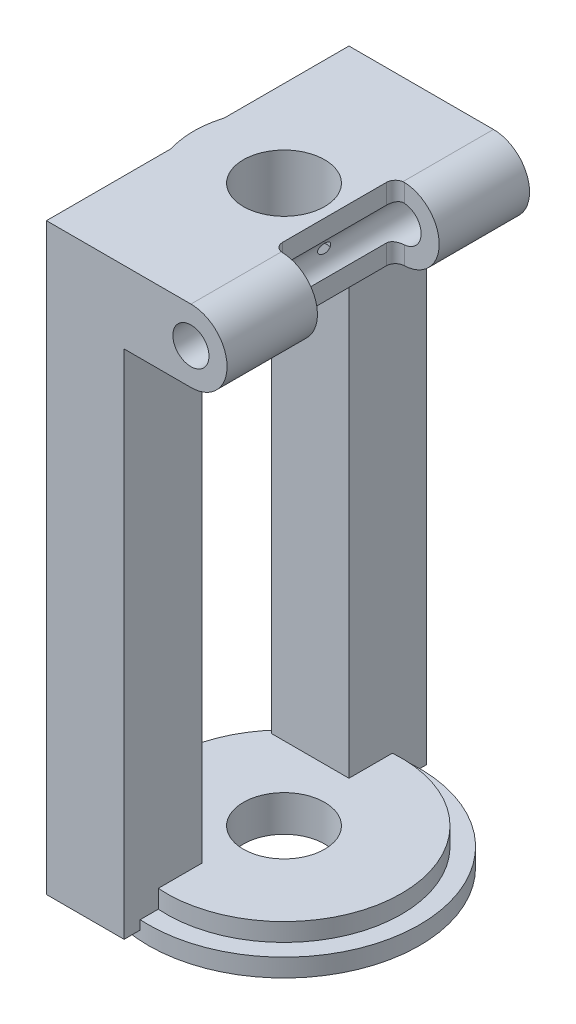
ISO-10303-21;
HEADER;
FILE_DESCRIPTION(('STEP AP214'),'2;1');
FILE_NAME('part.step','',(''),(''),'','','');
FILE_SCHEMA(('AUTOMOTIVE_DESIGN { 1 0 10303 214 1 1 1 1 }'));
ENDSEC;
DATA;
#1=APPLICATION_CONTEXT('core data for automotive mechanical design processes');
#2=APPLICATION_PROTOCOL_DEFINITION('international standard','automotive_design',2000,#1);
#3=PRODUCT_CONTEXT('',#1,'mechanical');
#4=PRODUCT('Part','Part','',(#3));
#5=PRODUCT_RELATED_PRODUCT_CATEGORY('part','',(#4));
#6=PRODUCT_DEFINITION_FORMATION('','',#4);
#7=PRODUCT_DEFINITION_CONTEXT('part definition',#1,'design');
#8=PRODUCT_DEFINITION('design','',#6,#7);
#9=PRODUCT_DEFINITION_SHAPE('','',#8);
#10=(LENGTH_UNIT() NAMED_UNIT(*) SI_UNIT(.MILLI.,.METRE.));
#11=(NAMED_UNIT(*) PLANE_ANGLE_UNIT() SI_UNIT($,.RADIAN.));
#12=(NAMED_UNIT(*) SI_UNIT($,.STERADIAN.) SOLID_ANGLE_UNIT());
#13=UNCERTAINTY_MEASURE_WITH_UNIT(LENGTH_MEASURE(1.E-05),#10,'distance_accuracy_value','');
#14=(GEOMETRIC_REPRESENTATION_CONTEXT(3) GLOBAL_UNCERTAINTY_ASSIGNED_CONTEXT((#13)) GLOBAL_UNIT_ASSIGNED_CONTEXT((#10,
#11,#12)) REPRESENTATION_CONTEXT('',''));
#15=CARTESIAN_POINT('',(0.,0.,0.));
#16=DIRECTION('',(0.,0.,1.));
#17=DIRECTION('',(1.,0.,0.));
#18=AXIS2_PLACEMENT_3D('',#15,#16,#17);
#19=CARTESIAN_POINT('',(18.4404896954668,114.629063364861,16.75));
#20=DIRECTION('',(0.,0.,-1.));
#21=DIRECTION('',(-1.,0.,0.));
#22=AXIS2_PLACEMENT_3D('',#19,#20,#21);
#23=CYLINDRICAL_SURFACE('',#22,4.);
#24=DIRECTION('',(0.,0.,-1.));
#25=VECTOR('',#24,1.);
#26=CARTESIAN_POINT('',(18.4404896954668,110.629063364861,16.75));
#27=LINE('',#26,#25);
#28=CARTESIAN_POINT('',(18.4404896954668,110.629063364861,16.75));
#29=VERTEX_POINT('',#28);
#30=CARTESIAN_POINT('',(18.4404896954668,110.629063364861,6.73169670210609));
#31=VERTEX_POINT('',#30);
#32=EDGE_CURVE('E548',#29,#31,#27,.T.);
#33=ORIENTED_EDGE('',*,*,#32,.T.);
#34=CARTESIAN_POINT('',(18.4404896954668,110.629063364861,6.73169670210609));
#35=CARTESIAN_POINT('',(18.465836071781,110.629060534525,6.73561529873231));
#36=CARTESIAN_POINT('',(18.4912530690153,110.629302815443,6.73855478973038));
#37=CARTESIAN_POINT('',(18.5422283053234,110.630277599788,6.74247556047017));
#38=CARTESIAN_POINT('',(18.5677865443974,110.631010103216,6.74345684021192));
#39=CARTESIAN_POINT('',(18.5934154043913,110.631987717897,6.74345901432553));
#40=B_SPLINE_CURVE_WITH_KNOTS('',3,(#34,#35,#36,#37,#38,#39),.UNSPECIFIED.,.F.,.F.,(4,2,4),(0.,
0.0767626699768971,0.153525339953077),.UNSPECIFIED.);
#41=CARTESIAN_POINT('',(18.5934154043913,110.631987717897,6.7434590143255));
#42=VERTEX_POINT('',#41);
#43=EDGE_CURVE('E373',#31,#42,#40,.T.);
#44=ORIENTED_EDGE('',*,*,#43,.T.);
#45=CARTESIAN_POINT('',(18.4404896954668,114.629063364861,6.7434590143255));
#46=DIRECTION('',(0.,0.,1.));
#47=DIRECTION('',(1.,0.,0.));
#48=AXIS2_PLACEMENT_3D('',#45,#46,#47);
#49=CIRCLE('',#48,4.);
#50=CARTESIAN_POINT('',(18.5934154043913,118.626139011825,6.7434590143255));
#51=VERTEX_POINT('',#50);
#52=EDGE_CURVE('E395',#42,#51,#49,.T.);
#53=ORIENTED_EDGE('',*,*,#52,.T.);
#54=CARTESIAN_POINT('',(18.5934154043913,118.626139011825,6.7434590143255));
#55=CARTESIAN_POINT('',(18.5677865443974,118.627116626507,6.7434568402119));
#56=CARTESIAN_POINT('',(18.5422283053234,118.627849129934,6.74247556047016));
#57=CARTESIAN_POINT('',(18.4912530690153,118.628823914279,6.73855478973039));
#58=CARTESIAN_POINT('',(18.465836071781,118.629066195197,6.73561529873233));
#59=CARTESIAN_POINT('',(18.4404896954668,118.629063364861,6.73169670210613));
#60=B_SPLINE_CURVE_WITH_KNOTS('',3,(#54,#55,#56,#57,#58,#59),.UNSPECIFIED.,.F.,.F.,(4,2,4),(0.,
0.0767626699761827,0.153525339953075),.UNSPECIFIED.);
#61=CARTESIAN_POINT('',(18.4404896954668,118.629063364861,6.73169670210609));
#62=VERTEX_POINT('',#61);
#63=EDGE_CURVE('E367',#51,#62,#60,.T.);
#64=ORIENTED_EDGE('',*,*,#63,.T.);
#65=DIRECTION('',(0.,0.,-1.));
#66=VECTOR('',#65,1.);
#67=CARTESIAN_POINT('',(18.4404896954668,118.629063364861,16.75));
#68=LINE('',#67,#66);
#69=CARTESIAN_POINT('',(18.4404896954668,118.629063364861,16.75));
#70=VERTEX_POINT('',#69);
#71=EDGE_CURVE('E265',#70,#62,#68,.T.);
#72=ORIENTED_EDGE('',*,*,#71,.F.);
#73=CARTESIAN_POINT('',(18.4404896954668,114.629063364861,16.75));
#74=DIRECTION('',(0.,0.,1.));
#75=DIRECTION('',(1.,0.,0.));
#76=AXIS2_PLACEMENT_3D('',#73,#74,#75);
#77=CIRCLE('',#76,4.);
#78=EDGE_CURVE('E538',#29,#70,#77,.T.);
#79=ORIENTED_EDGE('',*,*,#78,.F.);
#80=EDGE_LOOP('',(#33,#44,#53,#64,#72,#79));
#81=FACE_BOUND('',#80,.T.);
#82=ADVANCED_FACE('F32',(#81),#23,.T.);
#83=CARTESIAN_POINT('',(18.4404896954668,110.629063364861,16.75));
#84=DIRECTION('',(0.,1.,0.));
#85=DIRECTION('',(0.,0.,1.));
#86=AXIS2_PLACEMENT_3D('',#83,#84,#85);
#87=PLANE('',#86);
#88=CARTESIAN_POINT('',(12.,110.629063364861,-1.37356350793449E-13));
#89=DIRECTION('',(0.,1.,0.));
#90=DIRECTION('',(0.,0.,1.));
#91=AXIS2_PLACEMENT_3D('',#88,#89,#90);
#92=CIRCLE('',#91,4.5);
#93=CARTESIAN_POINT('',(12.,110.629063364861,4.49999999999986));
#94=VERTEX_POINT('',#93);
#95=EDGE_CURVE('E414',#94,#94,#92,.T.);
#96=ORIENTED_EDGE('',*,*,#95,.T.);
#97=EDGE_LOOP('',(#96));
#98=FACE_BOUND('',#97,.T.);
#99=CARTESIAN_POINT('',(18.4404896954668,110.629063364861,-6.73169670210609));
#100=VERTEX_POINT('',#99);
#101=CARTESIAN_POINT('',(18.4404896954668,110.629063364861,-16.75));
#102=VERTEX_POINT('',#101);
#103=EDGE_CURVE('E61',#100,#102,#27,.T.);
#104=ORIENTED_EDGE('',*,*,#103,.F.);
#105=CARTESIAN_POINT('',(18.5934154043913,110.629063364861,-5.7434590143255));
#106=DIRECTION('',(0.,1.,0.));
#107=DIRECTION('',(0.,0.,1.));
#108=AXIS2_PLACEMENT_3D('',#105,#106,#107);
#109=CIRCLE('',#108,1.);
#110=CARTESIAN_POINT('',(17.5934154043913,110.629063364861,-5.7434590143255));
#111=VERTEX_POINT('',#110);
#112=EDGE_CURVE('E608',#100,#111,#109,.T.);
#113=ORIENTED_EDGE('',*,*,#112,.T.);
#114=DIRECTION('',(0.,0.,1.));
#115=VECTOR('',#114,1.);
#116=CARTESIAN_POINT('',(17.5934154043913,110.629063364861,6.7434590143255));
#117=LINE('',#116,#115);
#118=CARTESIAN_POINT('',(17.5934154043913,110.629063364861,5.7434590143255));
#119=VERTEX_POINT('',#118);
#120=EDGE_CURVE('E404',#111,#119,#117,.T.);
#121=ORIENTED_EDGE('',*,*,#120,.T.);
#122=CARTESIAN_POINT('',(18.5934154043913,110.629063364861,5.7434590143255));
#123=DIRECTION('',(0.,1.,0.));
#124=DIRECTION('',(0.,0.,1.));
#125=AXIS2_PLACEMENT_3D('',#122,#123,#124);
#126=CIRCLE('',#125,1.);
#127=EDGE_CURVE('E308',#119,#31,#126,.T.);
#128=ORIENTED_EDGE('',*,*,#127,.T.);
#129=ORIENTED_EDGE('',*,*,#32,.F.);
#130=DIRECTION('',(1.,0.,0.));
#131=VECTOR('',#130,1.);
#132=CARTESIAN_POINT('',(18.4404896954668,110.629063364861,16.75));
#133=LINE('',#132,#131);
#134=CARTESIAN_POINT('',(11.0404896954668,110.629063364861,16.75));
#135=VERTEX_POINT('',#134);
#136=EDGE_CURVE('E546',#135,#29,#133,.T.);
#137=ORIENTED_EDGE('',*,*,#136,.F.);
#138=DIRECTION('',(0.,0.,1.));
#139=VECTOR('',#138,1.);
#140=CARTESIAN_POINT('',(11.0404896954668,110.629063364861,16.75));
#141=LINE('',#140,#139);
#142=CARTESIAN_POINT('',(11.0404896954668,110.629063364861,8.15));
#143=VERTEX_POINT('',#142);
#144=EDGE_CURVE('E501',#143,#135,#141,.T.);
#145=ORIENTED_EDGE('',*,*,#144,.F.);
#146=DIRECTION('',(1.,0.,0.));
#147=VECTOR('',#146,1.);
#148=CARTESIAN_POINT('',(2.44048969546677,110.629063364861,8.15));
#149=LINE('',#148,#147);
#150=CARTESIAN_POINT('',(2.44048969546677,110.629063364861,8.15));
#151=VERTEX_POINT('',#150);
#152=EDGE_CURVE('E477',#151,#143,#149,.T.);
#153=ORIENTED_EDGE('',*,*,#152,.F.);
#154=DIRECTION('',(0.,0.,-1.));
#155=VECTOR('',#154,1.);
#156=CARTESIAN_POINT('',(2.44048969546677,110.629063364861,16.75));
#157=LINE('',#156,#155);
#158=CARTESIAN_POINT('',(2.44048969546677,110.629063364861,2.93526195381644));
#159=VERTEX_POINT('',#158);
#160=EDGE_CURVE('E551',#151,#159,#157,.T.);
#161=ORIENTED_EDGE('',*,*,#160,.T.);
#162=CARTESIAN_POINT('',(12.,110.629063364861,-1.37356350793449E-13));
#163=DIRECTION('',(0.,1.,0.));
#164=DIRECTION('',(0.,0.,1.));
#165=AXIS2_PLACEMENT_3D('',#162,#163,#164);
#166=CIRCLE('',#165,10.);
#167=CARTESIAN_POINT('',(2.44048969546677,110.629063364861,-2.93526195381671));
#168=VERTEX_POINT('',#167);
#169=EDGE_CURVE('E515',#168,#159,#166,.T.);
#170=ORIENTED_EDGE('',*,*,#169,.F.);
#171=CARTESIAN_POINT('',(2.44048969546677,110.629063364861,-8.15));
#172=VERTEX_POINT('',#171);
#173=EDGE_CURVE('E550',#168,#172,#157,.T.);
#174=ORIENTED_EDGE('',*,*,#173,.T.);
#175=DIRECTION('',(-1.,0.,0.));
#176=VECTOR('',#175,1.);
#177=CARTESIAN_POINT('',(2.44048969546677,110.629063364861,-8.15));
#178=LINE('',#177,#176);
#179=CARTESIAN_POINT('',(11.0404896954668,110.629063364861,-8.15));
#180=VERTEX_POINT('',#179);
#181=EDGE_CURVE('E480',#180,#172,#178,.T.);
#182=ORIENTED_EDGE('',*,*,#181,.F.);
#183=DIRECTION('',(0.,0.,1.));
#184=VECTOR('',#183,1.);
#185=CARTESIAN_POINT('',(11.0404896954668,110.629063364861,-16.75));
#186=LINE('',#185,#184);
#187=CARTESIAN_POINT('',(11.0404896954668,110.629063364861,-16.75));
#188=VERTEX_POINT('',#187);
#189=EDGE_CURVE('E470',#188,#180,#186,.T.);
#190=ORIENTED_EDGE('',*,*,#189,.F.);
#191=DIRECTION('',(1.,0.,0.));
#192=VECTOR('',#191,1.);
#193=CARTESIAN_POINT('',(18.4404896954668,110.629063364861,-16.75));
#194=LINE('',#193,#192);
#195=EDGE_CURVE('E536',#188,#102,#194,.T.);
#196=ORIENTED_EDGE('',*,*,#195,.T.);
#197=EDGE_LOOP('',(#104,#113,#121,#128,#129,#137,#145,#153,#161,#170,#174,#182,#190,#196));
#198=FACE_BOUND('',#197,.T.);
#199=ADVANCED_FACE('F568',(#98,#198),#87,.F.);
#200=CARTESIAN_POINT('',(2.44048969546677,110.629063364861,16.75));
#201=DIRECTION('',(1.,0.,0.));
#202=DIRECTION('',(0.,0.,-1.));
#203=AXIS2_PLACEMENT_3D('',#200,#201,#202);
#204=PLANE('',#203);
#205=DIRECTION('',(0.,1.,0.));
#206=VECTOR('',#205,1.);
#207=CARTESIAN_POINT('',(2.44048969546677,112.476642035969,-8.80998085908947));
#208=LINE('',#207,#206);
#209=CARTESIAN_POINT('',(2.44048969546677,55.,-8.80998085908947));
#210=VERTEX_POINT('',#209);
#211=CARTESIAN_POINT('',(2.44048969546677,57.,-8.80998085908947));
#212=VERTEX_POINT('',#211);
#213=EDGE_CURVE('E452',#210,#212,#208,.T.);
#214=ORIENTED_EDGE('',*,*,#213,.T.);
#215=DIRECTION('',(0.,0.,1.));
#216=VECTOR('',#215,1.);
#217=CARTESIAN_POINT('',(2.44048969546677,57.,16.75));
#218=LINE('',#217,#216);
#219=CARTESIAN_POINT('',(2.44048969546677,57.,-8.15));
#220=VERTEX_POINT('',#219);
#221=EDGE_CURVE('E458',#212,#220,#218,.T.);
#222=ORIENTED_EDGE('',*,*,#221,.T.);
#223=DIRECTION('',(0.,1.,0.));
#224=VECTOR('',#223,1.);
#225=CARTESIAN_POINT('',(2.44048969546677,40.8377633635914,-8.15));
#226=LINE('',#225,#224);
#227=EDGE_CURVE('E483',#220,#172,#226,.T.);
#228=ORIENTED_EDGE('',*,*,#227,.T.);
#229=ORIENTED_EDGE('',*,*,#173,.F.);
#230=DIRECTION('',(0.,1.,0.));
#231=VECTOR('',#230,1.);
#232=CARTESIAN_POINT('',(2.44048969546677,110.629063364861,-2.93526195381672));
#233=LINE('',#232,#231);
#234=CARTESIAN_POINT('',(2.44048969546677,118.629063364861,-2.93526195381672));
#235=VERTEX_POINT('',#234);
#236=EDGE_CURVE('E519',#168,#235,#233,.T.);
#237=ORIENTED_EDGE('',*,*,#236,.T.);
#238=DIRECTION('',(0.,0.,-1.));
#239=VECTOR('',#238,1.);
#240=CARTESIAN_POINT('',(2.44048969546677,118.629063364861,16.75));
#241=LINE('',#240,#239);
#242=CARTESIAN_POINT('',(2.44048969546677,118.629063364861,-16.75));
#243=VERTEX_POINT('',#242);
#244=EDGE_CURVE('E553',#235,#243,#241,.T.);
#245=ORIENTED_EDGE('',*,*,#244,.T.);
#246=DIRECTION('',(0.,-1.,0.));
#247=VECTOR('',#246,1.);
#248=CARTESIAN_POINT('',(2.44048969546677,110.629063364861,-16.75));
#249=LINE('',#248,#247);
#250=CARTESIAN_POINT('',(2.44048969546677,54.,-16.75));
#251=VERTEX_POINT('',#250);
#252=EDGE_CURVE('E534',#243,#251,#249,.T.);
#253=ORIENTED_EDGE('',*,*,#252,.T.);
#254=DIRECTION('',(0.,0.,1.));
#255=VECTOR('',#254,1.);
#256=CARTESIAN_POINT('',(2.44048969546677,54.,-16.75));
#257=LINE('',#256,#255);
#258=CARTESIAN_POINT('',(2.44048969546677,54.,-11.5592284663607));
#259=VERTEX_POINT('',#258);
#260=EDGE_CURVE('E474',#251,#259,#257,.T.);
#261=ORIENTED_EDGE('',*,*,#260,.T.);
#262=DIRECTION('',(0.,1.,0.));
#263=VECTOR('',#262,1.);
#264=CARTESIAN_POINT('',(2.44048969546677,112.476642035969,-11.5592284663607));
#265=LINE('',#264,#263);
#266=CARTESIAN_POINT('',(2.44048969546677,55.,-11.5592284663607));
#267=VERTEX_POINT('',#266);
#268=EDGE_CURVE('E244',#259,#267,#265,.T.);
#269=ORIENTED_EDGE('',*,*,#268,.T.);
#270=DIRECTION('',(0.,0.,1.));
#271=VECTOR('',#270,1.);
#272=CARTESIAN_POINT('',(2.44048969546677,55.,16.75));
#273=LINE('',#272,#271);
#274=EDGE_CURVE('E443',#267,#210,#273,.T.);
#275=ORIENTED_EDGE('',*,*,#274,.T.);
#276=EDGE_LOOP('',(#214,#222,#228,#229,#237,#245,#253,#261,#269,#275));
#277=FACE_BOUND('',#276,.T.);
#278=ADVANCED_FACE('F576',(#277),#204,.F.);
#279=CARTESIAN_POINT('',(18.4404896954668,114.629063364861,16.75));
#280=DIRECTION('',(0.,0.,1.));
#281=DIRECTION('',(1.,0.,0.));
#282=AXIS2_PLACEMENT_3D('',#279,#280,#281);
#283=PLANE('',#282);
#284=ORIENTED_EDGE('',*,*,#78,.T.);
#285=DIRECTION('',(-1.,0.,0.));
#286=VECTOR('',#285,1.);
#287=CARTESIAN_POINT('',(18.4404896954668,118.629063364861,16.75));
#288=LINE('',#287,#286);
#289=CARTESIAN_POINT('',(2.44048969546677,118.629063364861,16.75));
#290=VERTEX_POINT('',#289);
#291=EDGE_CURVE('E541',#70,#290,#288,.T.);
#292=ORIENTED_EDGE('',*,*,#291,.T.);
#293=DIRECTION('',(0.,-1.,0.));
#294=VECTOR('',#293,1.);
#295=CARTESIAN_POINT('',(2.44048969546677,110.629063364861,16.75));
#296=LINE('',#295,#294);
#297=CARTESIAN_POINT('',(2.44048969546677,54.,16.75));
#298=VERTEX_POINT('',#297);
#299=EDGE_CURVE('E543',#290,#298,#296,.T.);
#300=ORIENTED_EDGE('',*,*,#299,.T.);
#301=DIRECTION('',(1.,0.,0.));
#302=VECTOR('',#301,1.);
#303=CARTESIAN_POINT('',(2.44048969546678,54.,16.75));
#304=LINE('',#303,#302);
#305=CARTESIAN_POINT('',(11.0404896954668,54.,16.75));
#306=VERTEX_POINT('',#305);
#307=EDGE_CURVE('E496',#298,#306,#304,.T.);
#308=ORIENTED_EDGE('',*,*,#307,.T.);
#309=DIRECTION('',(0.,1.,0.));
#310=VECTOR('',#309,1.);
#311=CARTESIAN_POINT('',(11.0404896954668,40.8377633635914,16.75));
#312=LINE('',#311,#310);
#313=EDGE_CURVE('E504',#306,#135,#312,.T.);
#314=ORIENTED_EDGE('',*,*,#313,.T.);
#315=ORIENTED_EDGE('',*,*,#136,.T.);
#316=EDGE_LOOP('',(#284,#292,#300,#308,#314,#315));
#317=FACE_BOUND('',#316,.T.);
#318=CARTESIAN_POINT('',(18.4404896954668,114.629063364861,16.75));
#319=DIRECTION('',(0.,0.,1.));
#320=DIRECTION('',(1.,0.,0.));
#321=AXIS2_PLACEMENT_3D('',#318,#319,#320);
#322=CIRCLE('',#321,2.);
#323=CARTESIAN_POINT('',(20.4404896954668,114.629063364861,16.75));
#324=VERTEX_POINT('',#323);
#325=EDGE_CURVE('E526',#324,#324,#322,.T.);
#326=ORIENTED_EDGE('',*,*,#325,.F.);
#327=EDGE_LOOP('',(#326));
#328=FACE_BOUND('',#327,.T.);
#329=ADVANCED_FACE('F589',(#317,#328),#283,.T.);
#330=CARTESIAN_POINT('',(18.4404896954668,114.629063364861,-16.75));
#331=DIRECTION('',(0.,0.,1.));
#332=DIRECTION('',(1.,0.,0.));
#333=AXIS2_PLACEMENT_3D('',#330,#331,#332);
#334=PLANE('',#333);
#335=CARTESIAN_POINT('',(18.4404896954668,114.629063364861,-16.75));
#336=DIRECTION('',(0.,0.,1.));
#337=DIRECTION('',(1.,0.,0.));
#338=AXIS2_PLACEMENT_3D('',#335,#336,#337);
#339=CIRCLE('',#338,4.);
#340=CARTESIAN_POINT('',(18.4404896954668,118.629063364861,-16.75));
#341=VERTEX_POINT('',#340);
#342=EDGE_CURVE('E529',#102,#341,#339,.T.);
#343=ORIENTED_EDGE('',*,*,#342,.F.);
#344=ORIENTED_EDGE('',*,*,#195,.F.);
#345=DIRECTION('',(0.,1.,0.));
#346=VECTOR('',#345,1.);
#347=CARTESIAN_POINT('',(11.0404896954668,40.8377633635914,-16.75));
#348=LINE('',#347,#346);
#349=CARTESIAN_POINT('',(11.0404896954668,54.,-16.75));
#350=VERTEX_POINT('',#349);
#351=EDGE_CURVE('E487',#350,#188,#348,.T.);
#352=ORIENTED_EDGE('',*,*,#351,.F.);
#353=DIRECTION('',(-1.,0.,0.));
#354=VECTOR('',#353,1.);
#355=CARTESIAN_POINT('',(2.44048969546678,54.,-16.75));
#356=LINE('',#355,#354);
#357=EDGE_CURVE('E473',#350,#251,#356,.T.);
#358=ORIENTED_EDGE('',*,*,#357,.T.);
#359=ORIENTED_EDGE('',*,*,#252,.F.);
#360=DIRECTION('',(-1.,0.,0.));
#361=VECTOR('',#360,1.);
#362=CARTESIAN_POINT('',(18.4404896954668,118.629063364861,-16.75));
#363=LINE('',#362,#361);
#364=EDGE_CURVE('E531',#341,#243,#363,.T.);
#365=ORIENTED_EDGE('',*,*,#364,.F.);
#366=EDGE_LOOP('',(#343,#344,#352,#358,#359,#365));
#367=FACE_BOUND('',#366,.T.);
#368=CARTESIAN_POINT('',(18.4404896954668,114.629063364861,-16.75));
#369=DIRECTION('',(0.,0.,1.));
#370=DIRECTION('',(1.,0.,0.));
#371=AXIS2_PLACEMENT_3D('',#368,#369,#370);
#372=CIRCLE('',#371,2.);
#373=CARTESIAN_POINT('',(20.4404896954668,114.629063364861,-16.75));
#374=VERTEX_POINT('',#373);
#375=EDGE_CURVE('E522',#374,#374,#372,.T.);
#376=ORIENTED_EDGE('',*,*,#375,.T.);
#377=EDGE_LOOP('',(#376));
#378=FACE_BOUND('',#377,.T.);
#379=ADVANCED_FACE('F323',(#367,#378),#334,.F.);
#380=CARTESIAN_POINT('',(18.4404896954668,118.629063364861,-6.73169670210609));
#381=VERTEX_POINT('',#380);
#382=EDGE_CURVE('E53',#381,#341,#68,.T.);
#383=ORIENTED_EDGE('',*,*,#382,.F.);
#384=CARTESIAN_POINT('',(18.4404896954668,118.629063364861,-6.73169670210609));
#385=CARTESIAN_POINT('',(18.465836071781,118.629066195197,-6.73561529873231));
#386=CARTESIAN_POINT('',(18.4912530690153,118.628823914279,-6.73855478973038));
#387=CARTESIAN_POINT('',(18.5422283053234,118.627849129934,-6.74247556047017));
#388=CARTESIAN_POINT('',(18.5677865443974,118.627116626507,-6.74345684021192));
#389=CARTESIAN_POINT('',(18.5934154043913,118.626139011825,-6.74345901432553));
#390=B_SPLINE_CURVE_WITH_KNOTS('',3,(#384,#385,#386,#387,#388,#389),.UNSPECIFIED.,.F.,.F.,(4,2,
4),(0.,0.0767626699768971,0.153525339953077),.UNSPECIFIED.);
#391=CARTESIAN_POINT('',(18.5934154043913,118.626139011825,-6.7434590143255));
#392=VERTEX_POINT('',#391);
#393=EDGE_CURVE('E46',#381,#392,#390,.T.);
#394=ORIENTED_EDGE('',*,*,#393,.T.);
#395=CARTESIAN_POINT('',(18.4404896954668,114.629063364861,-6.7434590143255));
#396=DIRECTION('',(0.,0.,-1.));
#397=DIRECTION('',(-1.,0.,0.));
#398=AXIS2_PLACEMENT_3D('',#395,#396,#397);
#399=CIRCLE('',#398,4.);
#400=CARTESIAN_POINT('',(18.5934154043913,110.631987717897,-6.7434590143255));
#401=VERTEX_POINT('',#400);
#402=EDGE_CURVE('E398',#392,#401,#399,.T.);
#403=ORIENTED_EDGE('',*,*,#402,.T.);
#404=CARTESIAN_POINT('',(18.5934154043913,110.631987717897,-6.7434590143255));
#405=CARTESIAN_POINT('',(18.5677865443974,110.631010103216,-6.7434568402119));
#406=CARTESIAN_POINT('',(18.5422283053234,110.630277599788,-6.74247556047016));
#407=CARTESIAN_POINT('',(18.4912530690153,110.629302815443,-6.73855478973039));
#408=CARTESIAN_POINT('',(18.465836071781,110.629060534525,-6.73561529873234));
#409=CARTESIAN_POINT('',(18.4404896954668,110.629063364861,-6.73169670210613));
#410=B_SPLINE_CURVE_WITH_KNOTS('',3,(#404,#405,#406,#407,#408,#409),.UNSPECIFIED.,.F.,.F.,(4,2,
4),(0.,0.0767626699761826,0.153525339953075),.UNSPECIFIED.);
#411=EDGE_CURVE('E349',#401,#100,#410,.T.);
#412=ORIENTED_EDGE('',*,*,#411,.T.);
#413=ORIENTED_EDGE('',*,*,#103,.T.);
#414=ORIENTED_EDGE('',*,*,#342,.T.);
#415=EDGE_LOOP('',(#383,#394,#403,#412,#413,#414));
#416=FACE_BOUND('',#415,.T.);
#417=ADVANCED_FACE('F34',(#416),#23,.T.);
#418=CARTESIAN_POINT('',(18.4404896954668,118.629063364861,16.75));
#419=DIRECTION('',(0.,-1.,0.));
#420=DIRECTION('',(0.,0.,-1.));
#421=AXIS2_PLACEMENT_3D('',#418,#419,#420);
#422=PLANE('',#421);
#423=CARTESIAN_POINT('',(12.,118.629063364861,-1.37356350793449E-13));
#424=DIRECTION('',(0.,1.,0.));
#425=DIRECTION('',(0.,0.,1.));
#426=AXIS2_PLACEMENT_3D('',#423,#424,#425);
#427=CIRCLE('',#426,4.5);
#428=CARTESIAN_POINT('',(12.,118.629063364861,4.49999999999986));
#429=VERTEX_POINT('',#428);
#430=EDGE_CURVE('E397',#429,#429,#427,.T.);
#431=ORIENTED_EDGE('',*,*,#430,.F.);
#432=EDGE_LOOP('',(#431));
#433=FACE_BOUND('',#432,.T.);
#434=ORIENTED_EDGE('',*,*,#71,.T.);
#435=CARTESIAN_POINT('',(18.5934154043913,118.629063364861,5.7434590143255));
#436=DIRECTION('',(0.,-1.,0.));
#437=DIRECTION('',(0.,0.,-1.));
#438=AXIS2_PLACEMENT_3D('',#435,#436,#437);
#439=CIRCLE('',#438,1.);
#440=CARTESIAN_POINT('',(17.5934154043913,118.629063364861,5.7434590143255));
#441=VERTEX_POINT('',#440);
#442=EDGE_CURVE('E372',#62,#441,#439,.T.);
#443=ORIENTED_EDGE('',*,*,#442,.T.);
#444=DIRECTION('',(0.,0.,1.));
#445=VECTOR('',#444,1.);
#446=CARTESIAN_POINT('',(17.5934154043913,118.629063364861,6.7434590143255));
#447=LINE('',#446,#445);
#448=CARTESIAN_POINT('',(17.5934154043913,118.629063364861,-5.7434590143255));
#449=VERTEX_POINT('',#448);
#450=EDGE_CURVE('E620',#449,#441,#447,.T.);
#451=ORIENTED_EDGE('',*,*,#450,.F.);
#452=CARTESIAN_POINT('',(18.5934154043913,118.629063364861,-5.7434590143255));
#453=DIRECTION('',(0.,-1.,0.));
#454=DIRECTION('',(0.,0.,-1.));
#455=AXIS2_PLACEMENT_3D('',#452,#453,#454);
#456=CIRCLE('',#455,1.);
#457=EDGE_CURVE('E560',#449,#381,#456,.T.);
#458=ORIENTED_EDGE('',*,*,#457,.T.);
#459=ORIENTED_EDGE('',*,*,#382,.T.);
#460=ORIENTED_EDGE('',*,*,#364,.T.);
#461=ORIENTED_EDGE('',*,*,#244,.F.);
#462=CARTESIAN_POINT('',(12.,118.629063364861,-1.37356350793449E-13));
#463=DIRECTION('',(0.,1.,0.));
#464=DIRECTION('',(0.,0.,1.));
#465=AXIS2_PLACEMENT_3D('',#462,#463,#464);
#466=CIRCLE('',#465,10.);
#467=CARTESIAN_POINT('',(2.44048969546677,118.629063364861,2.93526195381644));
#468=VERTEX_POINT('',#467);
#469=EDGE_CURVE('E498',#235,#468,#466,.T.);
#470=ORIENTED_EDGE('',*,*,#469,.T.);
#471=EDGE_CURVE('E554',#290,#468,#241,.T.);
#472=ORIENTED_EDGE('',*,*,#471,.F.);
#473=ORIENTED_EDGE('',*,*,#291,.F.);
#474=EDGE_LOOP('',(#434,#443,#451,#458,#459,#460,#461,#470,#472,#473));
#475=FACE_BOUND('',#474,.T.);
#476=ADVANCED_FACE('F557',(#433,#475),#422,.F.);
#477=DIRECTION('',(0.,1.,0.));
#478=VECTOR('',#477,1.);
#479=CARTESIAN_POINT('',(2.44048969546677,40.8377633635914,8.15));
#480=LINE('',#479,#478);
#481=CARTESIAN_POINT('',(2.44048969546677,57.,8.15));
#482=VERTEX_POINT('',#481);
#483=EDGE_CURVE('E509',#482,#151,#480,.T.);
#484=ORIENTED_EDGE('',*,*,#483,.F.);
#485=DIRECTION('',(0.,0.,1.));
#486=VECTOR('',#485,1.);
#487=CARTESIAN_POINT('',(2.44048969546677,57.,16.75));
#488=LINE('',#487,#486);
#489=CARTESIAN_POINT('',(2.44048969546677,57.,8.80998085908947));
#490=VERTEX_POINT('',#489);
#491=EDGE_CURVE('E467',#482,#490,#488,.T.);
#492=ORIENTED_EDGE('',*,*,#491,.T.);
#493=DIRECTION('',(0.,1.,0.));
#494=VECTOR('',#493,1.);
#495=CARTESIAN_POINT('',(2.44048969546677,112.476642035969,8.80998085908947));
#496=LINE('',#495,#494);
#497=CARTESIAN_POINT('',(2.44048969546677,55.,8.80998085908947));
#498=VERTEX_POINT('',#497);
#499=EDGE_CURVE('E449',#490,#498,#496,.F.);
#500=ORIENTED_EDGE('',*,*,#499,.T.);
#501=DIRECTION('',(0.,0.,1.));
#502=VECTOR('',#501,1.);
#503=CARTESIAN_POINT('',(2.44048969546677,55.,16.75));
#504=LINE('',#503,#502);
#505=CARTESIAN_POINT('',(2.44048969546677,55.,11.5592284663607));
#506=VERTEX_POINT('',#505);
#507=EDGE_CURVE('E440',#498,#506,#504,.T.);
#508=ORIENTED_EDGE('',*,*,#507,.T.);
#509=DIRECTION('',(0.,1.,0.));
#510=VECTOR('',#509,1.);
#511=CARTESIAN_POINT('',(2.44048969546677,112.476642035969,11.5592284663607));
#512=LINE('',#511,#510);
#513=CARTESIAN_POINT('',(2.44048969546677,54.,11.5592284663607));
#514=VERTEX_POINT('',#513);
#515=EDGE_CURVE('E436',#506,#514,#512,.F.);
#516=ORIENTED_EDGE('',*,*,#515,.T.);
#517=DIRECTION('',(0.,0.,1.));
#518=VECTOR('',#517,1.);
#519=CARTESIAN_POINT('',(2.44048969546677,54.,16.75));
#520=LINE('',#519,#518);
#521=EDGE_CURVE('E495',#514,#298,#520,.T.);
#522=ORIENTED_EDGE('',*,*,#521,.T.);
#523=ORIENTED_EDGE('',*,*,#299,.F.);
#524=ORIENTED_EDGE('',*,*,#471,.T.);
#525=DIRECTION('',(0.,1.,0.));
#526=VECTOR('',#525,1.);
#527=CARTESIAN_POINT('',(2.44048969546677,110.629063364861,2.93526195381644));
#528=LINE('',#527,#526);
#529=EDGE_CURVE('E518',#159,#468,#528,.T.);
#530=ORIENTED_EDGE('',*,*,#529,.F.);
#531=ORIENTED_EDGE('',*,*,#160,.F.);
#532=EDGE_LOOP('',(#484,#492,#500,#508,#516,#522,#523,#524,#530,#531));
#533=FACE_BOUND('',#532,.T.);
#534=ADVANCED_FACE('F320',(#533),#204,.F.);
#535=CARTESIAN_POINT('',(18.4404896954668,114.629063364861,16.75));
#536=DIRECTION('',(0.,0.,-1.));
#537=DIRECTION('',(-1.,0.,0.));
#538=AXIS2_PLACEMENT_3D('',#535,#536,#537);
#539=CYLINDRICAL_SURFACE('',#538,2.);
#540=CARTESIAN_POINT('',(18.4404896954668,114.629063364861,6.7434590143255));
#541=DIRECTION('',(0.,0.,1.));
#542=DIRECTION('',(1.,0.,0.));
#543=AXIS2_PLACEMENT_3D('',#540,#541,#542);
#544=CIRCLE('',#543,2.);
#545=CARTESIAN_POINT('',(18.5934154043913,112.634918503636,6.7434590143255));
#546=VERTEX_POINT('',#545);
#547=CARTESIAN_POINT('',(18.5934154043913,116.623208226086,6.7434590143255));
#548=VERTEX_POINT('',#547);
#549=EDGE_CURVE('E279',#546,#548,#544,.T.);
#550=ORIENTED_EDGE('',*,*,#549,.F.);
#551=CARTESIAN_POINT('',(18.5934154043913,112.634918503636,6.7434590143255));
#552=CARTESIAN_POINT('',(18.5675095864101,112.632929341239,6.74346027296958));
#553=CARTESIAN_POINT('',(18.5415769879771,112.631451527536,6.74245155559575));
#554=CARTESIAN_POINT('',(18.4898375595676,112.629505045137,6.73841877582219));
#555=CARTESIAN_POINT('',(18.4640306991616,112.629036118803,6.73539522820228));
#556=CARTESIAN_POINT('',(18.3872974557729,112.629120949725,6.72334769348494));
#557=CARTESIAN_POINT('',(18.3368029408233,112.631147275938,6.71134664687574));
#558=CARTESIAN_POINT('',(18.238572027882,112.638670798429,6.67980922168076));
#559=CARTESIAN_POINT('',(18.1908343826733,112.64416641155,6.66027628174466));
#560=CARTESIAN_POINT('',(18.0991980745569,112.657853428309,6.61430858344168));
#561=CARTESIAN_POINT('',(18.0553023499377,112.666046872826,6.58786860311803));
#562=CARTESIAN_POINT('',(17.9704765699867,112.68456968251,6.52753447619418));
#563=CARTESIAN_POINT('',(17.9297597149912,112.694976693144,6.49336524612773));
#564=CARTESIAN_POINT('',(17.854305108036,112.71649195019,6.41912199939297));
#565=CARTESIAN_POINT('',(17.8195712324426,112.727600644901,6.37904418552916));
#566=CARTESIAN_POINT('',(17.7543689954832,112.750095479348,6.29049827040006));
#567=CARTESIAN_POINT('',(17.7244379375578,112.761436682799,6.24162106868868));
#568=CARTESIAN_POINT('',(17.673244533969,112.781877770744,6.13913600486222));
#569=CARTESIAN_POINT('',(17.6519707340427,112.790980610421,6.08553450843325));
#570=CARTESIAN_POINT('',(17.6216165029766,112.804320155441,5.98412845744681));
#571=CARTESIAN_POINT('',(17.6111044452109,112.809111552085,5.93682418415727));
#572=CARTESIAN_POINT('',(17.5969749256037,112.815641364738,5.84085644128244));
#573=CARTESIAN_POINT('',(17.5933777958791,112.81737077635,5.79218938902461));
#574=CARTESIAN_POINT('',(17.5934154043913,112.817305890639,5.7434590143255));
#575=B_SPLINE_CURVE_WITH_KNOTS('',3,(#551,#552,#553,#554,#555,#556,#557,#558,#559,#560,#561,
#562,#563,#564,#565,#566,#567,#568,#569,#570,#571,#572,#573,#574),.UNSPECIFIED.,.F.,.F.,(4,2,2,
2,2,2,2,2,2,2,2,4),(0.,0.0778969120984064,0.155773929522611,0.310769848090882,0.465695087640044,
0.620737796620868,0.782550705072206,0.944468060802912,1.11890220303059,1.29310479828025,
1.4386009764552,1.58452430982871),.UNSPECIFIED.);
#576=CARTESIAN_POINT('',(17.5934154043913,112.817305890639,5.7434590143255));
#577=VERTEX_POINT('',#576);
#578=EDGE_CURVE('E302',#546,#577,#575,.T.);
#579=ORIENTED_EDGE('',*,*,#578,.T.);
#580=DIRECTION('',(0.,0.,-1.));
#581=VECTOR('',#580,1.);
#582=CARTESIAN_POINT('',(17.5934154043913,112.817305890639,16.75));
#583=LINE('',#582,#581);
#584=CARTESIAN_POINT('',(17.5934154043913,112.817305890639,-5.7434590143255));
#585=VERTEX_POINT('',#584);
#586=EDGE_CURVE('E273',#585,#577,#583,.F.);
#587=ORIENTED_EDGE('',*,*,#586,.F.);
#588=CARTESIAN_POINT('',(17.5934154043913,112.817305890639,-5.7434590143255));
#589=CARTESIAN_POINT('',(17.5934140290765,112.817310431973,-5.77030115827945));
#590=CARTESIAN_POINT('',(17.594496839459,112.816799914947,-5.79712878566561));
#591=CARTESIAN_POINT('',(17.598806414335,112.814792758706,-5.85056202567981));
#592=CARTESIAN_POINT('',(17.6020321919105,112.813296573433,-5.87716773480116));
#593=CARTESIAN_POINT('',(17.6148425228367,112.807415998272,-5.95611415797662));
#594=CARTESIAN_POINT('',(17.6275607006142,112.801638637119,-6.00787835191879));
#595=CARTESIAN_POINT('',(17.6608290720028,112.787202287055,-6.10826270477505));
#596=CARTESIAN_POINT('',(17.6813687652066,112.778547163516,-6.15688697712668));
#597=CARTESIAN_POINT('',(17.7296586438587,112.759466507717,-6.25009751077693));
#598=CARTESIAN_POINT('',(17.7574178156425,112.749038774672,-6.29467864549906));
#599=CARTESIAN_POINT('',(17.8213310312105,112.726998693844,-6.38139125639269));
#600=CARTESIAN_POINT('',(17.8578868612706,112.715352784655,-6.42321828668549));
#601=CARTESIAN_POINT('',(17.9375475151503,112.692891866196,-6.50036809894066));
#602=CARTESIAN_POINT('',(17.9806528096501,112.682076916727,-6.53569041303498));
#603=CARTESIAN_POINT('',(18.0738738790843,112.662358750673,-6.59983008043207));
#604=CARTESIAN_POINT('',(18.1241613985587,112.653522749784,-6.62842005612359));
#605=CARTESIAN_POINT('',(18.2293217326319,112.639538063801,-6.67661008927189));
#606=CARTESIAN_POINT('',(18.2841884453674,112.634384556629,-6.69622189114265));
#607=CARTESIAN_POINT('',(18.3816315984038,112.629504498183,-6.72170336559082));
#608=CARTESIAN_POINT('',(18.4235731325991,112.628695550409,-6.72984504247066));
#609=CARTESIAN_POINT('',(18.5081734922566,112.629753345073,-6.74073931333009));
#610=CARTESIAN_POINT('',(18.5508332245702,112.631623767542,-6.74348448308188));
#611=CARTESIAN_POINT('',(18.5934154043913,112.634918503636,-6.7434590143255));
#612=B_SPLINE_CURVE_WITH_KNOTS('',3,(#588,#589,#590,#591,#592,#593,#594,#595,#596,#597,#598,
#599,#600,#601,#602,#603,#604,#605,#606,#607,#608,#609,#610,#611),.UNSPECIFIED.,.F.,.F.,(4,2,2,
2,2,2,2,2,2,2,2,4),(0.,0.0804718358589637,0.160906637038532,0.320905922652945,0.480691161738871,
0.64067625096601,0.810198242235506,0.979732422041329,1.15436124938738,1.32876098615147,
1.45654461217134,1.58450391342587),.UNSPECIFIED.);
#613=CARTESIAN_POINT('',(18.5934154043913,112.634918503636,-6.7434590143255));
#614=VERTEX_POINT('',#613);
#615=EDGE_CURVE('E343',#585,#614,#612,.T.);
#616=ORIENTED_EDGE('',*,*,#615,.T.);
#617=CARTESIAN_POINT('',(18.4404896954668,114.629063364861,-6.7434590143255));
#618=DIRECTION('',(0.,0.,-1.));
#619=DIRECTION('',(-1.,0.,0.));
#620=AXIS2_PLACEMENT_3D('',#617,#618,#619);
#621=CIRCLE('',#620,2.);
#622=CARTESIAN_POINT('',(18.5934154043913,116.623208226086,-6.7434590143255));
#623=VERTEX_POINT('',#622);
#624=EDGE_CURVE('E270',#623,#614,#621,.T.);
#625=ORIENTED_EDGE('',*,*,#624,.F.);
#626=CARTESIAN_POINT('',(18.5934154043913,116.623208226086,-6.7434590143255));
#627=CARTESIAN_POINT('',(18.5675095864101,116.625197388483,-6.74346027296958));
#628=CARTESIAN_POINT('',(18.5415769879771,116.626675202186,-6.74245155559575));
#629=CARTESIAN_POINT('',(18.4898375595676,116.628621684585,-6.73841877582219));
#630=CARTESIAN_POINT('',(18.4640306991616,116.629090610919,-6.73539522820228));
#631=CARTESIAN_POINT('',(18.3872974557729,116.629005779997,-6.72334769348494));
#632=CARTESIAN_POINT('',(18.3368029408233,116.626979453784,-6.71134664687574));
#633=CARTESIAN_POINT('',(18.238572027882,116.619455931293,-6.67980922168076));
#634=CARTESIAN_POINT('',(18.1908343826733,116.613960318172,-6.66027628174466));
#635=CARTESIAN_POINT('',(18.0991980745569,116.600273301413,-6.61430858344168));
#636=CARTESIAN_POINT('',(18.0553023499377,116.592079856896,-6.58786860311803));
#637=CARTESIAN_POINT('',(17.9704765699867,116.573557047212,-6.52753447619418));
#638=CARTESIAN_POINT('',(17.9297597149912,116.563150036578,-6.49336524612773));
#639=CARTESIAN_POINT('',(17.854305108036,116.541634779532,-6.41912199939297));
#640=CARTESIAN_POINT('',(17.8195712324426,116.530526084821,-6.37904418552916));
#641=CARTESIAN_POINT('',(17.7543689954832,116.508031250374,-6.29049827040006));
#642=CARTESIAN_POINT('',(17.7244379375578,116.496690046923,-6.24162106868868));
#643=CARTESIAN_POINT('',(17.673244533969,116.476248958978,-6.13913600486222));
#644=CARTESIAN_POINT('',(17.6519707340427,116.467146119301,-6.08553450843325));
#645=CARTESIAN_POINT('',(17.6216165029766,116.453806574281,-5.98412845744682));
#646=CARTESIAN_POINT('',(17.6111044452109,116.449015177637,-5.93682418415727));
#647=CARTESIAN_POINT('',(17.5969749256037,116.442485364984,-5.84085644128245));
#648=CARTESIAN_POINT('',(17.5933777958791,116.440755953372,-5.79218938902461));
#649=CARTESIAN_POINT('',(17.5934154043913,116.440820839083,-5.7434590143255));
#650=B_SPLINE_CURVE_WITH_KNOTS('',3,(#626,#627,#628,#629,#630,#631,#632,#633,#634,#635,#636,
#637,#638,#639,#640,#641,#642,#643,#644,#645,#646,#647,#648,#649),.UNSPECIFIED.,.F.,.F.,(4,2,2,
2,2,2,2,2,2,2,2,4),(0.,0.0778969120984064,0.155773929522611,0.310769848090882,0.465695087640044,
0.620737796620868,0.782550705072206,0.944468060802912,1.11890220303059,1.29310479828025,
1.4386009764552,1.58452430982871),.UNSPECIFIED.);
#651=CARTESIAN_POINT('',(17.5934154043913,116.440820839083,-5.7434590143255));
#652=VERTEX_POINT('',#651);
#653=EDGE_CURVE('E11',#623,#652,#650,.T.);
#654=ORIENTED_EDGE('',*,*,#653,.T.);
#655=DIRECTION('',(0.,0.,-1.));
#656=VECTOR('',#655,1.);
#657=CARTESIAN_POINT('',(17.5934154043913,116.440820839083,16.75));
#658=LINE('',#657,#656);
#659=CARTESIAN_POINT('',(17.5934154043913,116.440820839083,5.7434590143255));
#660=VERTEX_POINT('',#659);
#661=EDGE_CURVE('E276',#660,#652,#658,.T.);
#662=ORIENTED_EDGE('',*,*,#661,.F.);
#663=CARTESIAN_POINT('',(17.5934154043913,116.440820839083,5.7434590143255));
#664=CARTESIAN_POINT('',(17.5934140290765,116.440816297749,5.77030115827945));
#665=CARTESIAN_POINT('',(17.594496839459,116.441326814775,5.79712878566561));
#666=CARTESIAN_POINT('',(17.598806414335,116.443333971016,5.85056202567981));
#667=CARTESIAN_POINT('',(17.6020321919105,116.444830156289,5.87716773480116));
#668=CARTESIAN_POINT('',(17.6148425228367,116.45071073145,5.95611415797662));
#669=CARTESIAN_POINT('',(17.6275607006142,116.456488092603,6.00787835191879));
#670=CARTESIAN_POINT('',(17.6608290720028,116.470924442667,6.10826270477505));
#671=CARTESIAN_POINT('',(17.6813687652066,116.479579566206,6.15688697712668));
#672=CARTESIAN_POINT('',(17.7296586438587,116.498660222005,6.25009751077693));
#673=CARTESIAN_POINT('',(17.7574178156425,116.50908795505,6.29467864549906));
#674=CARTESIAN_POINT('',(17.8213310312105,116.531128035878,6.38139125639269));
#675=CARTESIAN_POINT('',(17.8578868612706,116.542773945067,6.42321828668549));
#676=CARTESIAN_POINT('',(17.9375475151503,116.565234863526,6.50036809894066));
#677=CARTESIAN_POINT('',(17.9806528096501,116.576049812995,6.53569041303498));
#678=CARTESIAN_POINT('',(18.0738738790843,116.595767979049,6.59983008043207));
#679=CARTESIAN_POINT('',(18.1241613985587,116.604603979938,6.62842005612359));
#680=CARTESIAN_POINT('',(18.2293217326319,116.618588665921,6.67661008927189));
#681=CARTESIAN_POINT('',(18.2841884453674,116.623742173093,6.69622189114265));
#682=CARTESIAN_POINT('',(18.3816315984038,116.628622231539,6.72170336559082));
#683=CARTESIAN_POINT('',(18.4235731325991,116.629431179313,6.72984504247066));
#684=CARTESIAN_POINT('',(18.5081734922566,116.628373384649,6.74073931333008));
#685=CARTESIAN_POINT('',(18.5508332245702,116.62650296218,6.74348448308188));
#686=CARTESIAN_POINT('',(18.5934154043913,116.623208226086,6.7434590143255));
#687=B_SPLINE_CURVE_WITH_KNOTS('',3,(#663,#664,#665,#666,#667,#668,#669,#670,#671,#672,#673,
#674,#675,#676,#677,#678,#679,#680,#681,#682,#683,#684,#685,#686),.UNSPECIFIED.,.F.,.F.,(4,2,2,
2,2,2,2,2,2,2,2,4),(0.,0.0804718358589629,0.160906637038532,0.320905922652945,0.480691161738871,
0.640676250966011,0.810198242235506,0.979732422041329,1.15436124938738,1.32876098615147,
1.45654461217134,1.58450391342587),.UNSPECIFIED.);
#688=EDGE_CURVE('E337',#660,#548,#687,.T.);
#689=ORIENTED_EDGE('',*,*,#688,.T.);
#690=EDGE_LOOP('',(#550,#579,#587,#616,#625,#654,#662,#689));
#691=FACE_BOUND('',#690,.T.);
#692=CARTESIAN_POINT('',(16.4404896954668,114.629063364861,0.729418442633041));
#693=CARTESIAN_POINT('',(16.4404903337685,114.608049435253,0.729415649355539));
#694=CARTESIAN_POINT('',(16.4408258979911,114.587001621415,0.727380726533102));
#695=CARTESIAN_POINT('',(16.44212184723,114.545654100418,0.719422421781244));
#696=CARTESIAN_POINT('',(16.4430837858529,114.525356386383,0.713489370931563));
#697=CARTESIAN_POINT('',(16.4454967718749,114.486292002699,0.69829520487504));
#698=CARTESIAN_POINT('',(16.4469437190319,114.467514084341,0.689061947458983));
#699=CARTESIAN_POINT('',(16.4501768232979,114.431629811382,0.667863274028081));
#700=CARTESIAN_POINT('',(16.4519630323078,114.414523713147,0.655897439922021));
#701=CARTESIAN_POINT('',(16.4565689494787,114.374864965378,0.623981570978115));
#702=CARTESIAN_POINT('',(16.459494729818,114.353278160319,0.60284868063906));
#703=CARTESIAN_POINT('',(16.4654012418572,114.313744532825,0.557423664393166));
#704=CARTESIAN_POINT('',(16.4683820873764,114.295806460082,0.533124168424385));
#705=CARTESIAN_POINT('',(16.4754690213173,114.255863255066,0.47069773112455));
#706=CARTESIAN_POINT('',(16.4794641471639,114.235766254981,0.431340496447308));
#707=CARTESIAN_POINT('',(16.4865601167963,114.201917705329,0.349946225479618));
#708=CARTESIAN_POINT('',(16.4896595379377,114.188176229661,0.307905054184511));
#709=CARTESIAN_POINT('',(16.4955483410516,114.16276713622,0.208075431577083));
#710=CARTESIAN_POINT('',(16.4978923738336,114.153306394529,0.14969686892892));
#711=CARTESIAN_POINT('',(16.5002717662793,114.14370342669,0.0320781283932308));
#712=CARTESIAN_POINT('',(16.5003030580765,114.143577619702,-0.0271633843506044));
#713=CARTESIAN_POINT('',(16.4980406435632,114.152707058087,-0.14549526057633));
#714=CARTESIAN_POINT('',(16.4957232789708,114.162057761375,-0.204577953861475));
#715=CARTESIAN_POINT('',(16.4889763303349,114.191080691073,-0.319991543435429));
#716=CARTESIAN_POINT('',(16.484554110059,114.210716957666,-0.37633128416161));
#717=CARTESIAN_POINT('',(16.4766688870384,114.250121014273,-0.458573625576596));
#718=CARTESIAN_POINT('',(16.4737001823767,114.265674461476,-0.486557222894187));
#719=CARTESIAN_POINT('',(16.4675615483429,114.300625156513,-0.540009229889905));
#720=CARTESIAN_POINT('',(16.4643918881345,114.320017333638,-0.565480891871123));
#721=CARTESIAN_POINT('',(16.4588386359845,114.358241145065,-0.607541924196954));
#722=CARTESIAN_POINT('',(16.4564347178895,114.376268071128,-0.62485561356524));
#723=CARTESIAN_POINT('',(16.4518965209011,114.414882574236,-0.656407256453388));
#724=CARTESIAN_POINT('',(16.4497618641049,114.435466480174,-0.670649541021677));
#725=CARTESIAN_POINT('',(16.4463957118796,114.474500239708,-0.692576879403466));
#726=CARTESIAN_POINT('',(16.4450687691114,114.492520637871,-0.701007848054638));
#727=CARTESIAN_POINT('',(16.4428712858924,114.529731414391,-0.71480343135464));
#728=CARTESIAN_POINT('',(16.4420004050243,114.548920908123,-0.720170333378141));
#729=CARTESIAN_POINT('',(16.4408134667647,114.588075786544,-0.727454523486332));
#730=CARTESIAN_POINT('',(16.4405003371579,114.608044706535,-0.729353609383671));
#731=CARTESIAN_POINT('',(16.4404795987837,114.647993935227,-0.729479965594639));
#732=CARTESIAN_POINT('',(16.4407719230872,114.667974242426,-0.727707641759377));
#733=CARTESIAN_POINT('',(16.4418756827,114.705674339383,-0.720937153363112));
#734=CARTESIAN_POINT('',(16.4426430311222,114.723445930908,-0.716212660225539));
#735=CARTESIAN_POINT('',(16.4445768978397,114.758031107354,-0.704111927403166));
#736=CARTESIAN_POINT('',(16.4457435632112,114.774844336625,-0.696734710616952));
#737=CARTESIAN_POINT('',(16.4488437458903,114.812996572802,-0.676700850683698));
#738=CARTESIAN_POINT('',(16.4509025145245,114.833829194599,-0.663099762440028));
#739=CARTESIAN_POINT('',(16.4553225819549,114.87299376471,-0.63272219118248));
#740=CARTESIAN_POINT('',(16.4576844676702,114.891320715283,-0.6159395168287));
#741=CARTESIAN_POINT('',(16.4634928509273,114.932508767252,-0.572609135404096));
#742=CARTESIAN_POINT('',(16.4669850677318,114.954124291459,-0.544888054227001));
#743=CARTESIAN_POINT('',(16.4737343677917,114.992734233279,-0.486390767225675));
#744=CARTESIAN_POINT('',(16.4769909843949,115.009719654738,-0.45560877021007));
#745=CARTESIAN_POINT('',(16.4843479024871,115.046197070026,-0.377819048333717));
#746=CARTESIAN_POINT('',(16.4881731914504,115.06340684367,-0.329716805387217));
#747=CARTESIAN_POINT('',(16.4943199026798,115.090155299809,-0.231369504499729));
#748=CARTESIAN_POINT('',(16.4966395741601,115.099685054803,-0.181122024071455));
#749=CARTESIAN_POINT('',(16.4996238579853,115.111847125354,-0.0781974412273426));
#750=CARTESIAN_POINT('',(16.5002355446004,115.114259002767,-0.0254930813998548));
#751=CARTESIAN_POINT('',(16.4996010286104,115.111716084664,0.079730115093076));
#752=CARTESIAN_POINT('',(16.4983550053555,115.106762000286,0.132248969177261));
#753=CARTESIAN_POINT('',(16.4943035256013,115.089960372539,0.231225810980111));
#754=CARTESIAN_POINT('',(16.4916494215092,115.078777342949,0.277802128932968));
#755=CARTESIAN_POINT('',(16.4851054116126,115.049424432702,0.368628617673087));
#756=CARTESIAN_POINT('',(16.4812174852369,115.031265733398,0.412882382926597));
#757=CARTESIAN_POINT('',(16.4741052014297,114.994508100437,0.482881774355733));
#758=CARTESIAN_POINT('',(16.4711018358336,114.978139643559,0.509820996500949));
#759=CARTESIAN_POINT('',(16.4649708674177,114.941584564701,0.560975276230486));
#760=CARTESIAN_POINT('',(16.4618434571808,114.921403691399,0.585194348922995));
#761=CARTESIAN_POINT('',(16.4565298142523,114.88241845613,0.624204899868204));
#762=CARTESIAN_POINT('',(16.4543003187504,114.864482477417,0.639854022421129));
#763=CARTESIAN_POINT('',(16.450147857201,114.826309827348,0.668122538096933));
#764=CARTESIAN_POINT('',(16.4482245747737,114.806075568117,0.68074506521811));
#765=CARTESIAN_POINT('',(16.4452155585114,114.767560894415,0.700097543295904));
#766=CARTESIAN_POINT('',(16.4440405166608,114.749619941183,0.70748743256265));
#767=CARTESIAN_POINT('',(16.4421572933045,114.712761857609,0.719218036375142));
#768=CARTESIAN_POINT('',(16.4414479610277,114.693847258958,0.72356626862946));
#769=CARTESIAN_POINT('',(16.4408380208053,114.667154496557,0.727295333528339));
#770=CARTESIAN_POINT('',(16.4407077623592,114.659560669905,0.728089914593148));
#771=CARTESIAN_POINT('',(16.4405334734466,114.644333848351,0.729152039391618));
#772=CARTESIAN_POINT('',(16.440489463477,114.63670084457,0.729419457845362));
#773=CARTESIAN_POINT('',(16.4404896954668,114.629063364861,0.729418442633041));
#774=B_SPLINE_CURVE_WITH_KNOTS('',3,(#692,#693,#694,#695,#696,#697,#698,#699,#700,#701,#702,
#703,#704,#705,#706,#707,#708,#709,#710,#711,#712,#713,#714,#715,#716,#717,#718,#719,#720,#721,
#722,#723,#724,#725,#726,#727,#728,#729,#730,#731,#732,#733,#734,#735,#736,#737,#738,#739,#740,
#741,#742,#743,#744,#745,#746,#747,#748,#749,#750,#751,#752,#753,#754,#755,#756,#757,#758,#759,
#760,#761,#762,#763,#764,#765,#766,#767,#768,#769,#770,#771,#772,#773),.UNSPECIFIED.,.T.,.F.,(4,
2,2,2,2,2,2,2,2,2,2,2,2,2,2,2,2,2,2,2,2,2,2,2,2,2,2,2,2,2,2,2,2,2,2,2,2,2,2,2,4),(0.,
0.0630049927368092,0.126166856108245,0.188807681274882,0.251458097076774,0.34200155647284,
0.432759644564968,0.565144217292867,0.697737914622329,0.874396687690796,1.05136617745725,
1.23013619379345,1.4082853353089,1.50449754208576,1.60058349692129,1.67565815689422,
1.75062625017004,1.81020334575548,1.86973590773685,1.92958006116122,1.98941759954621,
2.04439552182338,2.09939371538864,2.1738727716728,2.24849827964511,2.35388896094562,
2.4594829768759,2.61235089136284,2.76539624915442,2.92313406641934,3.08085665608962,
3.22430372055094,3.36752180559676,3.46225165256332,3.55683978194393,3.62831757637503,
3.69972103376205,3.75780697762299,3.81574884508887,3.83864247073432,3.86154153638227),.UNSPECIFIED.);
#775=CARTESIAN_POINT('',(16.4404896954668,114.629063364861,0.729418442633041));
#776=VERTEX_POINT('',#775);
#777=EDGE_CURVE('E328',#776,#776,#774,.T.);
#778=ORIENTED_EDGE('',*,*,#777,.F.);
#779=EDGE_LOOP('',(#778));
#780=FACE_BOUND('',#779,.T.);
#781=ORIENTED_EDGE('',*,*,#325,.T.);
#782=EDGE_LOOP('',(#781));
#783=FACE_BOUND('',#782,.T.);
#784=ORIENTED_EDGE('',*,*,#375,.F.);
#785=EDGE_LOOP('',(#784));
#786=FACE_BOUND('',#785,.T.);
#787=ADVANCED_FACE('F314',(#691,#780,#783,#786),#539,.F.);
#788=CARTESIAN_POINT('',(12.,110.629063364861,-1.37356350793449E-13));
#789=DIRECTION('',(0.,1.,0.));
#790=DIRECTION('',(0.,0.,1.));
#791=AXIS2_PLACEMENT_3D('',#788,#789,#790);
#792=CYLINDRICAL_SURFACE('',#791,10.);
#793=ORIENTED_EDGE('',*,*,#469,.F.);
#794=ORIENTED_EDGE('',*,*,#236,.F.);
#795=ORIENTED_EDGE('',*,*,#169,.T.);
#796=ORIENTED_EDGE('',*,*,#529,.T.);
#797=EDGE_LOOP('',(#793,#794,#795,#796));
#798=FACE_BOUND('',#797,.T.);
#799=ADVANCED_FACE('F319',(#798),#792,.T.);
#800=CARTESIAN_POINT('',(11.0404896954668,40.8377633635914,16.75));
#801=DIRECTION('',(-1.,0.,0.));
#802=DIRECTION('',(0.,0.,1.));
#803=AXIS2_PLACEMENT_3D('',#800,#801,#802);
#804=PLANE('',#803);
#805=DIRECTION('',(0.,1.,0.));
#806=VECTOR('',#805,1.);
#807=CARTESIAN_POINT('',(11.0404896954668,112.476642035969,12.9645416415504));
#808=LINE('',#807,#806);
#809=CARTESIAN_POINT('',(11.0404896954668,55.,12.9645416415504));
#810=VERTEX_POINT('',#809);
#811=CARTESIAN_POINT('',(11.0404896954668,57.,12.9645416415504));
#812=VERTEX_POINT('',#811);
#813=EDGE_CURVE('E446',#810,#812,#808,.T.);
#814=ORIENTED_EDGE('',*,*,#813,.T.);
#815=DIRECTION('',(0.,0.,-1.));
#816=VECTOR('',#815,1.);
#817=CARTESIAN_POINT('',(11.0404896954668,57.,16.75));
#818=LINE('',#817,#816);
#819=CARTESIAN_POINT('',(11.0404896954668,57.,8.15));
#820=VERTEX_POINT('',#819);
#821=EDGE_CURVE('E464',#812,#820,#818,.T.);
#822=ORIENTED_EDGE('',*,*,#821,.T.);
#823=DIRECTION('',(0.,1.,0.));
#824=VECTOR('',#823,1.);
#825=CARTESIAN_POINT('',(11.0404896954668,40.8377633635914,8.15));
#826=LINE('',#825,#824);
#827=EDGE_CURVE('E507',#820,#143,#826,.T.);
#828=ORIENTED_EDGE('',*,*,#827,.T.);
#829=ORIENTED_EDGE('',*,*,#144,.T.);
#830=ORIENTED_EDGE('',*,*,#313,.F.);
#831=DIRECTION('',(0.,0.,-1.));
#832=VECTOR('',#831,1.);
#833=CARTESIAN_POINT('',(11.0404896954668,54.,16.75));
#834=LINE('',#833,#832);
#835=CARTESIAN_POINT('',(11.0404896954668,54.,14.9692798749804));
#836=VERTEX_POINT('',#835);
#837=EDGE_CURVE('E492',#306,#836,#834,.T.);
#838=ORIENTED_EDGE('',*,*,#837,.T.);
#839=DIRECTION('',(0.,1.,0.));
#840=VECTOR('',#839,1.);
#841=CARTESIAN_POINT('',(11.0404896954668,112.476642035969,14.9692798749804));
#842=LINE('',#841,#840);
#843=CARTESIAN_POINT('',(11.0404896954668,55.,14.9692798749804));
#844=VERTEX_POINT('',#843);
#845=EDGE_CURVE('E434',#836,#844,#842,.T.);
#846=ORIENTED_EDGE('',*,*,#845,.T.);
#847=DIRECTION('',(0.,0.,-1.));
#848=VECTOR('',#847,1.);
#849=CARTESIAN_POINT('',(11.0404896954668,55.,16.75));
#850=LINE('',#849,#848);
#851=EDGE_CURVE('E253',#844,#810,#850,.T.);
#852=ORIENTED_EDGE('',*,*,#851,.T.);
#853=EDGE_LOOP('',(#814,#822,#828,#829,#830,#838,#846,#852));
#854=FACE_BOUND('',#853,.T.);
#855=ADVANCED_FACE('F595',(#854),#804,.F.);
#856=CARTESIAN_POINT('',(2.44048969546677,40.8377633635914,8.15));
#857=DIRECTION('',(0.,0.,1.));
#858=DIRECTION('',(1.,0.,0.));
#859=AXIS2_PLACEMENT_3D('',#856,#857,#858);
#860=PLANE('',#859);
#861=ORIENTED_EDGE('',*,*,#827,.F.);
#862=DIRECTION('',(-1.,0.,0.));
#863=VECTOR('',#862,1.);
#864=CARTESIAN_POINT('',(2.44048969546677,57.,8.15));
#865=LINE('',#864,#863);
#866=EDGE_CURVE('E461',#820,#482,#865,.T.);
#867=ORIENTED_EDGE('',*,*,#866,.T.);
#868=ORIENTED_EDGE('',*,*,#483,.T.);
#869=ORIENTED_EDGE('',*,*,#152,.T.);
#870=EDGE_LOOP('',(#861,#867,#868,#869));
#871=FACE_BOUND('',#870,.T.);
#872=ADVANCED_FACE('F669',(#871),#860,.F.);
#873=CARTESIAN_POINT('',(-4.00838091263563,54.,-48.0767655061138));
#874=DIRECTION('',(0.,1.,0.));
#875=DIRECTION('',(-1.,0.,0.));
#876=AXIS2_PLACEMENT_3D('',#873,#874,#875);
#877=PLANE('',#876);
#878=ORIENTED_EDGE('',*,*,#521,.F.);
#879=CARTESIAN_POINT('',(12.,54.,0.));
#880=DIRECTION('',(0.,1.,0.));
#881=DIRECTION('',(-1.,0.,0.));
#882=AXIS2_PLACEMENT_3D('',#879,#880,#881);
#883=CIRCLE('',#882,15.);
#884=EDGE_CURVE('E431',#514,#836,#883,.T.);
#885=ORIENTED_EDGE('',*,*,#884,.T.);
#886=ORIENTED_EDGE('',*,*,#837,.F.);
#887=ORIENTED_EDGE('',*,*,#307,.F.);
#888=EDGE_LOOP('',(#878,#885,#886,#887));
#889=FACE_BOUND('',#888,.T.);
#890=ADVANCED_FACE('F592',(#889),#877,.F.);
#891=CARTESIAN_POINT('',(2.44048969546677,40.8377633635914,-8.15));
#892=DIRECTION('',(0.,0.,-1.));
#893=DIRECTION('',(-1.,0.,0.));
#894=AXIS2_PLACEMENT_3D('',#891,#892,#893);
#895=PLANE('',#894);
#896=ORIENTED_EDGE('',*,*,#227,.F.);
#897=DIRECTION('',(1.,0.,0.));
#898=VECTOR('',#897,1.);
#899=CARTESIAN_POINT('',(2.44048969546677,57.,-8.15));
#900=LINE('',#899,#898);
#901=CARTESIAN_POINT('',(11.0404896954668,57.,-8.15));
#902=VERTEX_POINT('',#901);
#903=EDGE_CURVE('E455',#220,#902,#900,.T.);
#904=ORIENTED_EDGE('',*,*,#903,.T.);
#905=DIRECTION('',(0.,1.,0.));
#906=VECTOR('',#905,1.);
#907=CARTESIAN_POINT('',(11.0404896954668,40.8377633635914,-8.15));
#908=LINE('',#907,#906);
#909=EDGE_CURVE('E485',#902,#180,#908,.T.);
#910=ORIENTED_EDGE('',*,*,#909,.T.);
#911=ORIENTED_EDGE('',*,*,#181,.T.);
#912=EDGE_LOOP('',(#896,#904,#910,#911));
#913=FACE_BOUND('',#912,.T.);
#914=ADVANCED_FACE('F682',(#913),#895,.F.);
#915=CARTESIAN_POINT('',(11.0404896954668,40.8377633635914,-16.75));
#916=DIRECTION('',(-1.,0.,0.));
#917=DIRECTION('',(0.,0.,1.));
#918=AXIS2_PLACEMENT_3D('',#915,#916,#917);
#919=PLANE('',#918);
#920=ORIENTED_EDGE('',*,*,#909,.F.);
#921=DIRECTION('',(0.,0.,-1.));
#922=VECTOR('',#921,1.);
#923=CARTESIAN_POINT('',(11.0404896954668,57.,-16.75));
#924=LINE('',#923,#922);
#925=CARTESIAN_POINT('',(11.0404896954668,57.,-12.9645416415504));
#926=VERTEX_POINT('',#925);
#927=EDGE_CURVE('E263',#902,#926,#924,.T.);
#928=ORIENTED_EDGE('',*,*,#927,.T.);
#929=DIRECTION('',(0.,1.,0.));
#930=VECTOR('',#929,1.);
#931=CARTESIAN_POINT('',(11.0404896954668,112.476642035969,-12.9645416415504));
#932=LINE('',#931,#930);
#933=CARTESIAN_POINT('',(11.0404896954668,55.,-12.9645416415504));
#934=VERTEX_POINT('',#933);
#935=EDGE_CURVE('E261',#926,#934,#932,.F.);
#936=ORIENTED_EDGE('',*,*,#935,.T.);
#937=DIRECTION('',(0.,0.,-1.));
#938=VECTOR('',#937,1.);
#939=CARTESIAN_POINT('',(11.0404896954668,55.,-16.75));
#940=LINE('',#939,#938);
#941=CARTESIAN_POINT('',(11.0404896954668,55.,-14.9692798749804));
#942=VERTEX_POINT('',#941);
#943=EDGE_CURVE('E250',#934,#942,#940,.T.);
#944=ORIENTED_EDGE('',*,*,#943,.T.);
#945=DIRECTION('',(0.,1.,0.));
#946=VECTOR('',#945,1.);
#947=CARTESIAN_POINT('',(11.0404896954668,112.476642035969,-14.9692798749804));
#948=LINE('',#947,#946);
#949=CARTESIAN_POINT('',(11.0404896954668,54.,-14.9692798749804));
#950=VERTEX_POINT('',#949);
#951=EDGE_CURVE('E234',#942,#950,#948,.F.);
#952=ORIENTED_EDGE('',*,*,#951,.T.);
#953=DIRECTION('',(0.,0.,-1.));
#954=VECTOR('',#953,1.);
#955=CARTESIAN_POINT('',(11.0404896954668,54.,-16.75));
#956=LINE('',#955,#954);
#957=EDGE_CURVE('E471',#950,#350,#956,.T.);
#958=ORIENTED_EDGE('',*,*,#957,.T.);
#959=ORIENTED_EDGE('',*,*,#351,.T.);
#960=ORIENTED_EDGE('',*,*,#189,.T.);
#961=EDGE_LOOP('',(#920,#928,#936,#944,#952,#958,#959,#960));
#962=FACE_BOUND('',#961,.T.);
#963=ADVANCED_FACE('F259',(#962),#919,.F.);
#964=CARTESIAN_POINT('',(-4.00838091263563,54.,-48.0767655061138));
#965=DIRECTION('',(0.,1.,0.));
#966=DIRECTION('',(-1.,0.,0.));
#967=AXIS2_PLACEMENT_3D('',#964,#965,#966);
#968=PLANE('',#967);
#969=ORIENTED_EDGE('',*,*,#957,.F.);
#970=CARTESIAN_POINT('',(12.,54.,0.));
#971=DIRECTION('',(0.,1.,0.));
#972=DIRECTION('',(-1.,0.,0.));
#973=AXIS2_PLACEMENT_3D('',#970,#971,#972);
#974=CIRCLE('',#973,15.);
#975=EDGE_CURVE('E240',#950,#259,#974,.T.);
#976=ORIENTED_EDGE('',*,*,#975,.T.);
#977=ORIENTED_EDGE('',*,*,#260,.F.);
#978=ORIENTED_EDGE('',*,*,#357,.F.);
#979=EDGE_LOOP('',(#969,#976,#977,#978));
#980=FACE_BOUND('',#979,.T.);
#981=ADVANCED_FACE('F574',(#980),#968,.F.);
#982=CARTESIAN_POINT('',(12.,57.,0.));
#983=DIRECTION('',(0.,1.,0.));
#984=DIRECTION('',(0.,0.,1.));
#985=AXIS2_PLACEMENT_3D('',#982,#983,#984);
#986=PLANE('',#985);
#987=CARTESIAN_POINT('',(12.,57.,-1.37356350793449E-13));
#988=DIRECTION('',(0.,1.,0.));
#989=DIRECTION('',(0.,0.,1.));
#990=AXIS2_PLACEMENT_3D('',#987,#988,#989);
#991=CIRCLE('',#990,4.5);
#992=CARTESIAN_POINT('',(12.,57.,4.49999999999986));
#993=VERTEX_POINT('',#992);
#994=EDGE_CURVE('E409',#993,#993,#991,.T.);
#995=ORIENTED_EDGE('',*,*,#994,.F.);
#996=EDGE_LOOP('',(#995));
#997=FACE_BOUND('',#996,.T.);
#998=ORIENTED_EDGE('',*,*,#491,.F.);
#999=ORIENTED_EDGE('',*,*,#866,.F.);
#1000=ORIENTED_EDGE('',*,*,#821,.F.);
#1001=CARTESIAN_POINT('',(12.,57.,0.));
#1002=DIRECTION('',(0.,1.,0.));
#1003=DIRECTION('',(0.,0.,1.));
#1004=AXIS2_PLACEMENT_3D('',#1001,#1002,#1003);
#1005=CIRCLE('',#1004,13.);
#1006=EDGE_CURVE('E426',#812,#926,#1005,.T.);
#1007=ORIENTED_EDGE('',*,*,#1006,.T.);
#1008=ORIENTED_EDGE('',*,*,#927,.F.);
#1009=ORIENTED_EDGE('',*,*,#903,.F.);
#1010=ORIENTED_EDGE('',*,*,#221,.F.);
#1011=EDGE_CURVE('E245',#212,#490,#1005,.T.);
#1012=ORIENTED_EDGE('',*,*,#1011,.T.);
#1013=EDGE_LOOP('',(#998,#999,#1000,#1007,#1008,#1009,#1010,#1012));
#1014=FACE_BOUND('',#1013,.T.);
#1015=ADVANCED_FACE('F702',(#997,#1014),#986,.T.);
#1016=CARTESIAN_POINT('',(12.,112.476642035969,0.));
#1017=DIRECTION('',(0.,1.,0.));
#1018=DIRECTION('',(0.,0.,1.));
#1019=AXIS2_PLACEMENT_3D('',#1016,#1017,#1018);
#1020=CYLINDRICAL_SURFACE('',#1019,13.);
#1021=ORIENTED_EDGE('',*,*,#213,.F.);
#1022=CARTESIAN_POINT('',(12.,55.,0.));
#1023=DIRECTION('',(0.,1.,0.));
#1024=DIRECTION('',(0.,0.,1.));
#1025=AXIS2_PLACEMENT_3D('',#1022,#1023,#1024);
#1026=CIRCLE('',#1025,13.);
#1027=EDGE_CURVE('E425',#210,#498,#1026,.T.);
#1028=ORIENTED_EDGE('',*,*,#1027,.T.);
#1029=ORIENTED_EDGE('',*,*,#499,.F.);
#1030=ORIENTED_EDGE('',*,*,#1011,.F.);
#1031=EDGE_LOOP('',(#1021,#1028,#1029,#1030));
#1032=FACE_BOUND('',#1031,.T.);
#1033=ADVANCED_FACE('F709',(#1032),#1020,.T.);
#1034=ORIENTED_EDGE('',*,*,#813,.F.);
#1035=EDGE_CURVE('E423',#810,#934,#1026,.T.);
#1036=ORIENTED_EDGE('',*,*,#1035,.T.);
#1037=ORIENTED_EDGE('',*,*,#935,.F.);
#1038=ORIENTED_EDGE('',*,*,#1006,.F.);
#1039=EDGE_LOOP('',(#1034,#1036,#1037,#1038));
#1040=FACE_BOUND('',#1039,.T.);
#1041=ADVANCED_FACE('F717',(#1040),#1020,.T.);
#1042=CARTESIAN_POINT('',(-0.999999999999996,55.,0.));
#1043=DIRECTION('',(0.,1.,0.));
#1044=DIRECTION('',(0.,0.,1.));
#1045=AXIS2_PLACEMENT_3D('',#1042,#1043,#1044);
#1046=PLANE('',#1045);
#1047=ORIENTED_EDGE('',*,*,#274,.F.);
#1048=CARTESIAN_POINT('',(12.,55.,0.));
#1049=DIRECTION('',(0.,1.,0.));
#1050=DIRECTION('',(0.,0.,1.));
#1051=AXIS2_PLACEMENT_3D('',#1048,#1049,#1050);
#1052=CIRCLE('',#1051,15.);
#1053=EDGE_CURVE('E254',#267,#506,#1052,.T.);
#1054=ORIENTED_EDGE('',*,*,#1053,.T.);
#1055=ORIENTED_EDGE('',*,*,#507,.F.);
#1056=ORIENTED_EDGE('',*,*,#1027,.F.);
#1057=EDGE_LOOP('',(#1047,#1054,#1055,#1056));
#1058=FACE_BOUND('',#1057,.T.);
#1059=ADVANCED_FACE('F725',(#1058),#1046,.T.);
#1060=ORIENTED_EDGE('',*,*,#851,.F.);
#1061=EDGE_CURVE('E237',#844,#942,#1052,.T.);
#1062=ORIENTED_EDGE('',*,*,#1061,.T.);
#1063=ORIENTED_EDGE('',*,*,#943,.F.);
#1064=ORIENTED_EDGE('',*,*,#1035,.F.);
#1065=EDGE_LOOP('',(#1060,#1062,#1063,#1064));
#1066=FACE_BOUND('',#1065,.T.);
#1067=ADVANCED_FACE('F248',(#1066),#1046,.T.);
#1068=CARTESIAN_POINT('',(12.,112.476642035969,0.));
#1069=DIRECTION('',(0.,1.,0.));
#1070=DIRECTION('',(0.,0.,1.));
#1071=AXIS2_PLACEMENT_3D('',#1068,#1069,#1070);
#1072=CYLINDRICAL_SURFACE('',#1071,15.);
#1073=CARTESIAN_POINT('',(12.,53.,0.));
#1074=DIRECTION('',(0.,1.,0.));
#1075=DIRECTION('',(0.,0.,1.));
#1076=AXIS2_PLACEMENT_3D('',#1073,#1074,#1075);
#1077=CIRCLE('',#1076,15.);
#1078=CARTESIAN_POINT('',(12.,53.,15.));
#1079=VERTEX_POINT('',#1078);
#1080=EDGE_CURVE('E255',#1079,#1079,#1077,.T.);
#1081=ORIENTED_EDGE('',*,*,#1080,.T.);
#1082=EDGE_LOOP('',(#1081));
#1083=FACE_BOUND('',#1082,.T.);
#1084=ORIENTED_EDGE('',*,*,#515,.F.);
#1085=ORIENTED_EDGE('',*,*,#1053,.F.);
#1086=ORIENTED_EDGE('',*,*,#268,.F.);
#1087=ORIENTED_EDGE('',*,*,#975,.F.);
#1088=ORIENTED_EDGE('',*,*,#951,.F.);
#1089=ORIENTED_EDGE('',*,*,#1061,.F.);
#1090=ORIENTED_EDGE('',*,*,#845,.F.);
#1091=ORIENTED_EDGE('',*,*,#884,.F.);
#1092=EDGE_LOOP('',(#1084,#1085,#1086,#1087,#1088,#1089,#1090,#1091));
#1093=FACE_BOUND('',#1092,.T.);
#1094=ADVANCED_FACE('F236',(#1083,#1093),#1072,.T.);
#1095=CARTESIAN_POINT('',(-3.,53.,0.));
#1096=DIRECTION('',(0.,-1.,0.));
#1097=DIRECTION('',(0.,0.,-1.));
#1098=AXIS2_PLACEMENT_3D('',#1095,#1096,#1097);
#1099=PLANE('',#1098);
#1100=CARTESIAN_POINT('',(12.,53.,-1.37356350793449E-13));
#1101=DIRECTION('',(0.,1.,0.));
#1102=DIRECTION('',(0.,0.,1.));
#1103=AXIS2_PLACEMENT_3D('',#1100,#1101,#1102);
#1104=CIRCLE('',#1103,4.5);
#1105=CARTESIAN_POINT('',(12.,53.,4.49999999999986));
#1106=VERTEX_POINT('',#1105);
#1107=EDGE_CURVE('E401',#1106,#1106,#1104,.T.);
#1108=ORIENTED_EDGE('',*,*,#1107,.T.);
#1109=EDGE_LOOP('',(#1108));
#1110=FACE_BOUND('',#1109,.T.);
#1111=ORIENTED_EDGE('',*,*,#1080,.F.);
#1112=EDGE_LOOP('',(#1111));
#1113=FACE_BOUND('',#1112,.T.);
#1114=ADVANCED_FACE('F744',(#1110,#1113),#1099,.T.);
#1115=CARTESIAN_POINT('',(12.,53.,-1.37356350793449E-13));
#1116=DIRECTION('',(0.,1.,0.));
#1117=DIRECTION('',(0.,0.,1.));
#1118=AXIS2_PLACEMENT_3D('',#1115,#1116,#1117);
#1119=CYLINDRICAL_SURFACE('',#1118,4.5);
#1120=ORIENTED_EDGE('',*,*,#994,.T.);
#1121=EDGE_LOOP('',(#1120));
#1122=FACE_BOUND('',#1121,.T.);
#1123=ORIENTED_EDGE('',*,*,#1107,.F.);
#1124=EDGE_LOOP('',(#1123));
#1125=FACE_BOUND('',#1124,.T.);
#1126=ADVANCED_FACE('F752',(#1122,#1125),#1119,.F.);
#1127=ORIENTED_EDGE('',*,*,#430,.T.);
#1128=EDGE_LOOP('',(#1127));
#1129=FACE_BOUND('',#1128,.T.);
#1130=ORIENTED_EDGE('',*,*,#777,.T.);
#1131=EDGE_LOOP('',(#1130));
#1132=FACE_BOUND('',#1131,.T.);
#1133=ORIENTED_EDGE('',*,*,#95,.F.);
#1134=EDGE_LOOP('',(#1133));
#1135=FACE_BOUND('',#1134,.T.);
#1136=ADVANCED_FACE('F628',(#1129,#1132,#1135),#1119,.F.);
#1137=CARTESIAN_POINT('',(22.4404896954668,110.629063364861,6.7434590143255));
#1138=DIRECTION('',(0.,0.,1.));
#1139=DIRECTION('',(1.,0.,0.));
#1140=AXIS2_PLACEMENT_3D('',#1137,#1138,#1139);
#1141=PLANE('',#1140);
#1142=ORIENTED_EDGE('',*,*,#52,.F.);
#1143=DIRECTION('',(0.,1.,0.));
#1144=VECTOR('',#1143,1.);
#1145=CARTESIAN_POINT('',(18.5934154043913,110.629063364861,6.7434590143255));
#1146=LINE('',#1145,#1144);
#1147=EDGE_CURVE('E285',#42,#546,#1146,.T.);
#1148=ORIENTED_EDGE('',*,*,#1147,.T.);
#1149=ORIENTED_EDGE('',*,*,#549,.T.);
#1150=DIRECTION('',(0.,1.,0.));
#1151=VECTOR('',#1150,1.);
#1152=CARTESIAN_POINT('',(18.5934154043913,110.629063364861,6.7434590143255));
#1153=LINE('',#1152,#1151);
#1154=EDGE_CURVE('E282',#548,#51,#1153,.T.);
#1155=ORIENTED_EDGE('',*,*,#1154,.T.);
#1156=EDGE_LOOP('',(#1142,#1148,#1149,#1155));
#1157=FACE_BOUND('',#1156,.T.);
#1158=ADVANCED_FACE('F389',(#1157),#1141,.F.);
#1159=CARTESIAN_POINT('',(17.5934154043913,110.629063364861,6.7434590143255));
#1160=DIRECTION('',(-1.,0.,0.));
#1161=DIRECTION('',(0.,0.,1.));
#1162=AXIS2_PLACEMENT_3D('',#1159,#1160,#1161);
#1163=PLANE('',#1162);
#1164=ORIENTED_EDGE('',*,*,#450,.T.);
#1165=DIRECTION('',(0.,1.,0.));
#1166=VECTOR('',#1165,1.);
#1167=CARTESIAN_POINT('',(17.5934154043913,110.629063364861,5.7434590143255));
#1168=LINE('',#1167,#1166);
#1169=EDGE_CURVE('E296',#441,#660,#1168,.F.);
#1170=ORIENTED_EDGE('',*,*,#1169,.T.);
#1171=ORIENTED_EDGE('',*,*,#661,.T.);
#1172=DIRECTION('',(0.,1.,0.));
#1173=VECTOR('',#1172,1.);
#1174=CARTESIAN_POINT('',(17.5934154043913,110.629063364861,-5.7434590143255));
#1175=LINE('',#1174,#1173);
#1176=EDGE_CURVE('E293',#652,#449,#1175,.T.);
#1177=ORIENTED_EDGE('',*,*,#1176,.T.);
#1178=EDGE_LOOP('',(#1164,#1170,#1171,#1177));
#1179=FACE_BOUND('',#1178,.T.);
#1180=ADVANCED_FACE('F619',(#1179),#1163,.F.);
#1181=CARTESIAN_POINT('',(22.4404896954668,110.629063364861,-6.7434590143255));
#1182=DIRECTION('',(0.,0.,-1.));
#1183=DIRECTION('',(-1.,0.,0.));
#1184=AXIS2_PLACEMENT_3D('',#1181,#1182,#1183);
#1185=PLANE('',#1184);
#1186=ORIENTED_EDGE('',*,*,#624,.T.);
#1187=DIRECTION('',(0.,1.,0.));
#1188=VECTOR('',#1187,1.);
#1189=CARTESIAN_POINT('',(18.5934154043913,110.629063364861,-6.7434590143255));
#1190=LINE('',#1189,#1188);
#1191=EDGE_CURVE('E300',#614,#401,#1190,.F.);
#1192=ORIENTED_EDGE('',*,*,#1191,.T.);
#1193=ORIENTED_EDGE('',*,*,#402,.F.);
#1194=DIRECTION('',(0.,1.,0.));
#1195=VECTOR('',#1194,1.);
#1196=CARTESIAN_POINT('',(18.5934154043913,110.629063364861,-6.7434590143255));
#1197=LINE('',#1196,#1195);
#1198=EDGE_CURVE('E298',#392,#623,#1197,.F.);
#1199=ORIENTED_EDGE('',*,*,#1198,.T.);
#1200=EDGE_LOOP('',(#1186,#1192,#1193,#1199));
#1201=FACE_BOUND('',#1200,.T.);
#1202=ADVANCED_FACE('F613',(#1201),#1185,.F.);
#1203=ORIENTED_EDGE('',*,*,#586,.T.);
#1204=DIRECTION('',(0.,1.,0.));
#1205=VECTOR('',#1204,1.);
#1206=CARTESIAN_POINT('',(17.5934154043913,110.629063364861,5.7434590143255));
#1207=LINE('',#1206,#1205);
#1208=EDGE_CURVE('E291',#577,#119,#1207,.F.);
#1209=ORIENTED_EDGE('',*,*,#1208,.T.);
#1210=ORIENTED_EDGE('',*,*,#120,.F.);
#1211=DIRECTION('',(0.,1.,0.));
#1212=VECTOR('',#1211,1.);
#1213=CARTESIAN_POINT('',(17.5934154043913,110.629063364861,-5.7434590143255));
#1214=LINE('',#1213,#1212);
#1215=EDGE_CURVE('E288',#111,#585,#1214,.T.);
#1216=ORIENTED_EDGE('',*,*,#1215,.T.);
#1217=EDGE_LOOP('',(#1203,#1209,#1210,#1216));
#1218=FACE_BOUND('',#1217,.T.);
#1219=ADVANCED_FACE('F606',(#1218),#1163,.F.);
#1220=CARTESIAN_POINT('',(18.5934154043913,110.629063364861,5.7434590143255));
#1221=DIRECTION('',(0.,-1.,0.));
#1222=DIRECTION('',(0.,0.,-1.));
#1223=AXIS2_PLACEMENT_3D('',#1220,#1221,#1222);
#1224=CYLINDRICAL_SURFACE('',#1223,1.);
#1225=ORIENTED_EDGE('',*,*,#127,.F.);
#1226=ORIENTED_EDGE('',*,*,#1208,.F.);
#1227=ORIENTED_EDGE('',*,*,#578,.F.);
#1228=ORIENTED_EDGE('',*,*,#1147,.F.);
#1229=ORIENTED_EDGE('',*,*,#43,.F.);
#1230=EDGE_LOOP('',(#1225,#1226,#1227,#1228,#1229));
#1231=FACE_BOUND('',#1230,.T.);
#1232=ADVANCED_FACE('F310',(#1231),#1224,.F.);
#1233=CARTESIAN_POINT('',(18.5934154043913,110.629063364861,5.7434590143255));
#1234=DIRECTION('',(0.,-1.,0.));
#1235=DIRECTION('',(0.,0.,-1.));
#1236=AXIS2_PLACEMENT_3D('',#1233,#1234,#1235);
#1237=CYLINDRICAL_SURFACE('',#1236,1.);
#1238=ORIENTED_EDGE('',*,*,#688,.F.);
#1239=ORIENTED_EDGE('',*,*,#1169,.F.);
#1240=ORIENTED_EDGE('',*,*,#442,.F.);
#1241=ORIENTED_EDGE('',*,*,#63,.F.);
#1242=ORIENTED_EDGE('',*,*,#1154,.F.);
#1243=EDGE_LOOP('',(#1238,#1239,#1240,#1241,#1242));
#1244=FACE_BOUND('',#1243,.T.);
#1245=ADVANCED_FACE('F358',(#1244),#1237,.F.);
#1246=CARTESIAN_POINT('',(18.5934154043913,110.629063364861,-5.7434590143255));
#1247=DIRECTION('',(0.,-1.,0.));
#1248=DIRECTION('',(0.,0.,-1.));
#1249=AXIS2_PLACEMENT_3D('',#1246,#1247,#1248);
#1250=CYLINDRICAL_SURFACE('',#1249,1.);
#1251=ORIENTED_EDGE('',*,*,#411,.F.);
#1252=ORIENTED_EDGE('',*,*,#1191,.F.);
#1253=ORIENTED_EDGE('',*,*,#615,.F.);
#1254=ORIENTED_EDGE('',*,*,#1215,.F.);
#1255=ORIENTED_EDGE('',*,*,#112,.F.);
#1256=EDGE_LOOP('',(#1251,#1252,#1253,#1254,#1255));
#1257=FACE_BOUND('',#1256,.T.);
#1258=ADVANCED_FACE('F354',(#1257),#1250,.F.);
#1259=CARTESIAN_POINT('',(18.5934154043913,110.629063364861,-5.7434590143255));
#1260=DIRECTION('',(0.,-1.,0.));
#1261=DIRECTION('',(0.,0.,-1.));
#1262=AXIS2_PLACEMENT_3D('',#1259,#1260,#1261);
#1263=CYLINDRICAL_SURFACE('',#1262,1.);
#1264=ORIENTED_EDGE('',*,*,#653,.F.);
#1265=ORIENTED_EDGE('',*,*,#1198,.F.);
#1266=ORIENTED_EDGE('',*,*,#393,.F.);
#1267=ORIENTED_EDGE('',*,*,#457,.F.);
#1268=ORIENTED_EDGE('',*,*,#1176,.F.);
#1269=EDGE_LOOP('',(#1264,#1265,#1266,#1267,#1268));
#1270=FACE_BOUND('',#1269,.T.);
#1271=ADVANCED_FACE('F357',(#1270),#1263,.F.);
#1272=CLOSED_SHELL('',(#82,#199,#278,#329,#379,#417,#476,#534,#787,#799,#855,#872,#890,#914,
#963,#981,#1015,#1033,#1041,#1059,#1067,#1094,#1114,#1126,#1136,#1158,#1180,#1202,#1219,#1232,
#1245,#1258,#1271));
#1273=MANIFOLD_SOLID_BREP('B2',#1272);
#1274=ADVANCED_BREP_SHAPE_REPRESENTATION('',(#18,#1273),#14);
#1275=SHAPE_DEFINITION_REPRESENTATION(#9,#1274);
ENDSEC;
END-ISO-10303-21;
